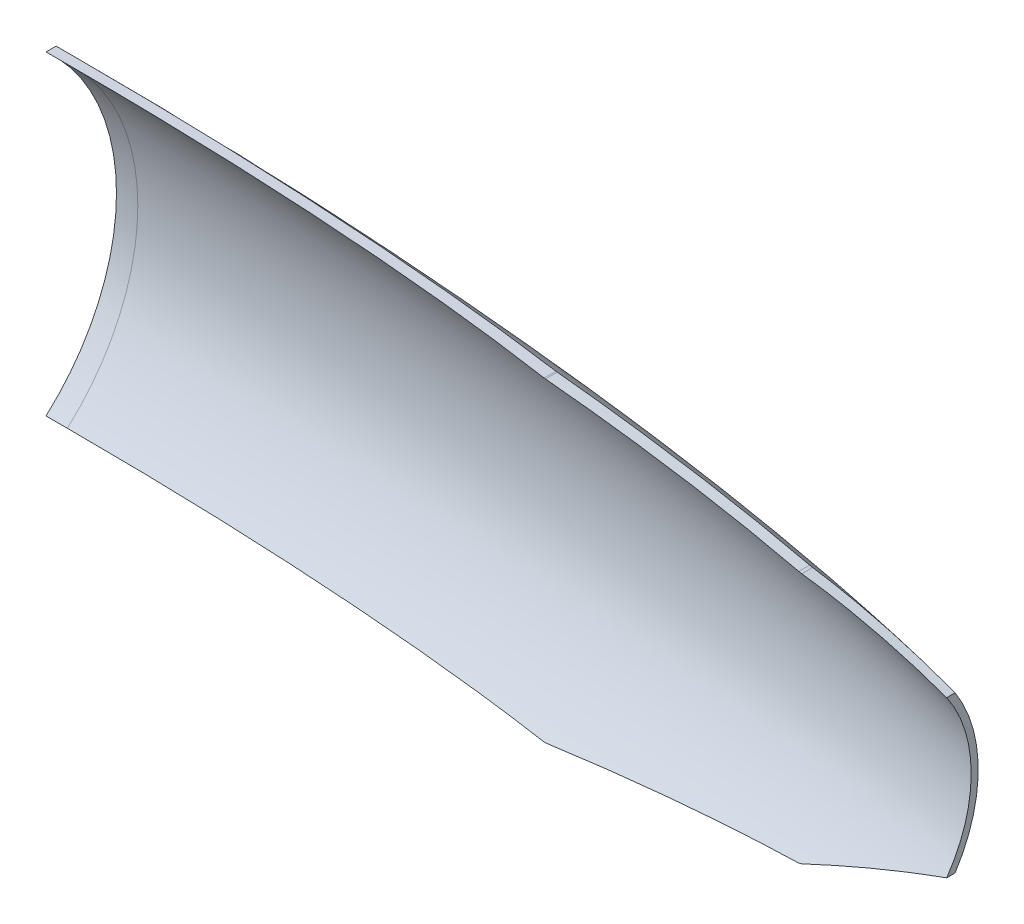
from build123d import *

# Parameters (mm, degrees)
BASE_REVOLVE_ANGLE           = 180
BASE_REVOLVE_OTHER_WAY_ANGLE = 180
SKETCH19_R                   = 101.346
EXTRUDE1_DEPTH               = 9.906
SHELL1_T                     = -3.175
SKETCH18_OUTSIDE_W           = 698.078
SKETCH18_OUTSIDE_H           = 332.064
CUT_EXTRUDE15_DEPTH          = 604.088327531


with BuildPart() as part:
    # Sketch1 → Base-Revolve (revolve)
    with BuildSketch(Plane.XY):
        with BuildLine():
            Line((558.8, 0), (0, 0))
            Line((0, 0), (0, 101.346))
            add(Edge.make_bspline(
                [(558.8, 0), (558.8, 101.346), (0, 101.346)],
                knots=[0, 0, 0, 1.570796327, 1.570796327, 1.570796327], degree=2, weights=[1, 0.707106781, 1]))
        make_face()
    revolve(axis=Axis((0, 0, 0), (1, 0, 0)), revolution_arc=BASE_REVOLVE_ANGLE)

    # Sketch1 → Base-Revolve other way (revolve)
    with BuildSketch(Plane.XY):
        with BuildLine():
            Line((558.8, 0), (0, 0))
            Line((0, 0), (0, 101.346))
            add(Edge.make_bspline(
                [(558.8, 0), (558.8, 101.346), (0, 101.346)],
                knots=[0, 0, 0, 1.570796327, 1.570796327, 1.570796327], degree=2, weights=[1, 0.707106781, 1]))
        make_face()
    revolve(axis=Axis((0, 0, 0), (-1, 0, 0)), revolution_arc=BASE_REVOLVE_OTHER_WAY_ANGLE)

    # Sketch19 → Extrude1 (add)
    with BuildSketch(Plane.ZY):
        Circle(SKETCH19_R)
    extrude(amount=EXTRUDE1_DEPTH)

    # Shell1
    shell1_openings = [part.faces().sort_by_distance(p)[0] for p in [
        (-9.906, 0, 0),
    ]]
    offset(amount=SHELL1_T, openings=shell1_openings, kind=Kind.INTERSECTION)

    # Sketch18 outside → Cut-Extrude15 (cut, through all)
    with BuildSketch(Plane.XY.offset(101.6)):
        with Locations((274.447, 0)):
            Rectangle(SKETCH18_OUTSIDE_W, SKETCH18_OUTSIDE_H)
        Polygon((0, 73.152), (-9.906, 73.152), (-9.906, -73.152), (0, -73.152), (236.728, -73.152), (237.392748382, -73.117109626), (358.970991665, -58.619391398), (360.290868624, -58.298635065), (421.64, -36.21294777), (421.64, 36.21294777), (360.290868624, 58.298635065), (358.970991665, 58.619391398), (237.392748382, 73.117109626), (236.728, 73.152), align=None, mode=Mode.SUBTRACT)
    extrude(amount=-CUT_EXTRUDE15_DEPTH, mode=Mode.SUBTRACT)


with BuildPart() as cut_extrude15_kept_piece:
    # of the separate pieces the step leaves, the one the design keeps (cut_extrude15_pieces_kept)
    add(part.part.solids().sort_by_distance((0, 73.152, -70.141261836))[0])


solid = cut_extrude15_kept_piece.part
